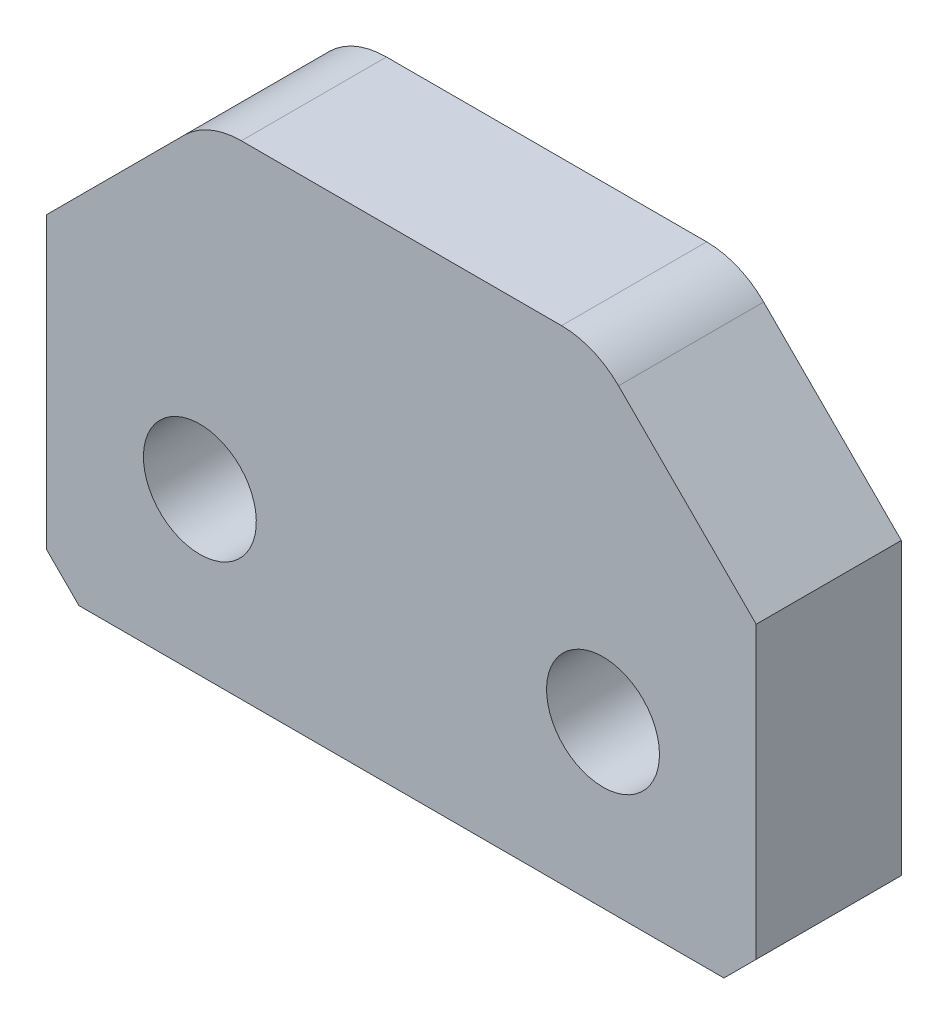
ISO-10303-21;
HEADER;
FILE_DESCRIPTION(('STEP AP214'),'2;1');
FILE_NAME('part.step','',(''),(''),'','','');
FILE_SCHEMA(('AUTOMOTIVE_DESIGN { 1 0 10303 214 1 1 1 1 }'));
ENDSEC;
DATA;
#1=APPLICATION_CONTEXT('core data for automotive mechanical design processes');
#2=APPLICATION_PROTOCOL_DEFINITION('international standard','automotive_design',2000,#1);
#3=PRODUCT_CONTEXT('',#1,'mechanical');
#4=PRODUCT('Part','Part','',(#3));
#5=PRODUCT_RELATED_PRODUCT_CATEGORY('part','',(#4));
#6=PRODUCT_DEFINITION_FORMATION('','',#4);
#7=PRODUCT_DEFINITION_CONTEXT('part definition',#1,'design');
#8=PRODUCT_DEFINITION('design','',#6,#7);
#9=PRODUCT_DEFINITION_SHAPE('','',#8);
#10=(LENGTH_UNIT() NAMED_UNIT(*) SI_UNIT(.MILLI.,.METRE.));
#11=(NAMED_UNIT(*) PLANE_ANGLE_UNIT() SI_UNIT($,.RADIAN.));
#12=(NAMED_UNIT(*) SI_UNIT($,.STERADIAN.) SOLID_ANGLE_UNIT());
#13=UNCERTAINTY_MEASURE_WITH_UNIT(LENGTH_MEASURE(1.E-05),#10,'distance_accuracy_value','');
#14=(GEOMETRIC_REPRESENTATION_CONTEXT(3) GLOBAL_UNCERTAINTY_ASSIGNED_CONTEXT((#13)) GLOBAL_UNIT_ASSIGNED_CONTEXT((#10,
#11,#12)) REPRESENTATION_CONTEXT('',''));
#15=CARTESIAN_POINT('',(0.,0.,0.));
#16=DIRECTION('',(0.,0.,1.));
#17=DIRECTION('',(1.,0.,0.));
#18=AXIS2_PLACEMENT_3D('',#15,#16,#17);
#19=CARTESIAN_POINT('',(2.57106781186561,15.,9.));
#20=DIRECTION('',(0.,0.,1.));
#21=DIRECTION('',(0.,-1.,0.));
#22=AXIS2_PLACEMENT_3D('',#19,#20,#21);
#23=PLANE('',#22);
#24=CARTESIAN_POINT('',(0.,0.,9.));
#25=DIRECTION('',(0.,0.,1.));
#26=DIRECTION('',(0.,-1.,0.));
#27=AXIS2_PLACEMENT_3D('',#24,#25,#26);
#28=CIRCLE('',#27,3.5);
#29=CARTESIAN_POINT('',(0.,-3.5,9.));
#30=VERTEX_POINT('',#29);
#31=EDGE_CURVE('E105',#30,#30,#28,.T.);
#32=ORIENTED_EDGE('',*,*,#31,.F.);
#33=EDGE_LOOP('',(#32));
#34=FACE_BOUND('',#33,.T.);
#35=CARTESIAN_POINT('',(2.57106781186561,15.,9.));
#36=DIRECTION('',(0.,0.,1.));
#37=DIRECTION('',(0.,-1.,0.));
#38=AXIS2_PLACEMENT_3D('',#35,#36,#37);
#39=CIRCLE('',#38,5.);
#40=CARTESIAN_POINT('',(2.57106781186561,20.,9.));
#41=VERTEX_POINT('',#40);
#42=CARTESIAN_POINT('',(-0.964466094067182,18.535533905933,9.));
#43=VERTEX_POINT('',#42);
#44=EDGE_CURVE('E134',#41,#43,#39,.T.);
#45=ORIENTED_EDGE('',*,*,#44,.T.);
#46=DIRECTION('',(0.707106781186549,0.707106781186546,0.));
#47=VECTOR('',#46,1.);
#48=CARTESIAN_POINT('',(-9.5,10.,9.));
#49=LINE('',#48,#47);
#50=CARTESIAN_POINT('',(-9.5,10.,9.));
#51=VERTEX_POINT('',#50);
#52=EDGE_CURVE('E97',#51,#43,#49,.T.);
#53=ORIENTED_EDGE('',*,*,#52,.F.);
#54=DIRECTION('',(0.,1.,0.));
#55=VECTOR('',#54,1.);
#56=CARTESIAN_POINT('',(-9.5,-8.,9.));
#57=LINE('',#56,#55);
#58=CARTESIAN_POINT('',(-9.5,-8.,9.));
#59=VERTEX_POINT('',#58);
#60=EDGE_CURVE('E137',#59,#51,#57,.T.);
#61=ORIENTED_EDGE('',*,*,#60,.F.);
#62=DIRECTION('',(-0.707106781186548,0.707106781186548,0.));
#63=VECTOR('',#62,1.);
#64=CARTESIAN_POINT('',(-7.5,-10.,9.));
#65=LINE('',#64,#63);
#66=CARTESIAN_POINT('',(-7.5,-10.,9.));
#67=VERTEX_POINT('',#66);
#68=EDGE_CURVE('E140',#67,#59,#65,.T.);
#69=ORIENTED_EDGE('',*,*,#68,.F.);
#70=DIRECTION('',(1.,0.,0.));
#71=VECTOR('',#70,1.);
#72=CARTESIAN_POINT('',(-7.5,-10.,9.));
#73=LINE('',#72,#71);
#74=CARTESIAN_POINT('',(32.5000000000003,-10.,9.));
#75=VERTEX_POINT('',#74);
#76=EDGE_CURVE('E143',#67,#75,#73,.T.);
#77=ORIENTED_EDGE('',*,*,#76,.T.);
#78=DIRECTION('',(-0.707106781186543,-0.707106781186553,0.));
#79=VECTOR('',#78,1.);
#80=CARTESIAN_POINT('',(34.5000000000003,-8.,9.));
#81=LINE('',#80,#79);
#82=CARTESIAN_POINT('',(34.5000000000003,-8.,9.));
#83=VERTEX_POINT('',#82);
#84=EDGE_CURVE('E146',#83,#75,#81,.T.);
#85=ORIENTED_EDGE('',*,*,#84,.F.);
#86=DIRECTION('',(0.,1.,0.));
#87=VECTOR('',#86,1.);
#88=CARTESIAN_POINT('',(34.5000000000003,-8.,9.));
#89=LINE('',#88,#87);
#90=CARTESIAN_POINT('',(34.5000000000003,10.,9.));
#91=VERTEX_POINT('',#90);
#92=EDGE_CURVE('E149',#83,#91,#89,.T.);
#93=ORIENTED_EDGE('',*,*,#92,.T.);
#94=DIRECTION('',(-0.707106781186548,0.707106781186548,0.));
#95=VECTOR('',#94,1.);
#96=CARTESIAN_POINT('',(34.5000000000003,10.,9.));
#97=LINE('',#96,#95);
#98=CARTESIAN_POINT('',(25.9644660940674,18.535533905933,9.));
#99=VERTEX_POINT('',#98);
#100=EDGE_CURVE('E152',#91,#99,#97,.T.);
#101=ORIENTED_EDGE('',*,*,#100,.T.);
#102=CARTESIAN_POINT('',(22.4289321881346,15.,9.));
#103=DIRECTION('',(0.,0.,1.));
#104=DIRECTION('',(0.,-1.,0.));
#105=AXIS2_PLACEMENT_3D('',#102,#103,#104);
#106=CIRCLE('',#105,5.);
#107=CARTESIAN_POINT('',(22.4289321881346,20.,9.));
#108=VERTEX_POINT('',#107);
#109=EDGE_CURVE('E155',#99,#108,#106,.T.);
#110=ORIENTED_EDGE('',*,*,#109,.T.);
#111=DIRECTION('',(1.,0.,0.));
#112=VECTOR('',#111,1.);
#113=CARTESIAN_POINT('',(2.57106781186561,20.,9.));
#114=LINE('',#113,#112);
#115=EDGE_CURVE('E157',#41,#108,#114,.T.);
#116=ORIENTED_EDGE('',*,*,#115,.F.);
#117=EDGE_LOOP('',(#45,#53,#61,#69,#77,#85,#93,#101,#110,#116));
#118=FACE_BOUND('',#117,.T.);
#119=CARTESIAN_POINT('',(25.,0.,9.));
#120=DIRECTION('',(0.,0.,1.));
#121=DIRECTION('',(0.,-1.,0.));
#122=AXIS2_PLACEMENT_3D('',#119,#120,#121);
#123=CIRCLE('',#122,3.5);
#124=CARTESIAN_POINT('',(25.,-3.5,9.));
#125=VERTEX_POINT('',#124);
#126=EDGE_CURVE('E329',#125,#125,#123,.T.);
#127=ORIENTED_EDGE('',*,*,#126,.F.);
#128=EDGE_LOOP('',(#127));
#129=FACE_BOUND('',#128,.T.);
#130=ADVANCED_FACE('F14',(#34,#118,#129),#23,.T.);
#131=CARTESIAN_POINT('',(2.57106781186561,15.,0.));
#132=DIRECTION('',(0.,0.,1.));
#133=DIRECTION('',(0.,-1.,0.));
#134=AXIS2_PLACEMENT_3D('',#131,#132,#133);
#135=PLANE('',#134);
#136=CARTESIAN_POINT('',(0.,0.,0.));
#137=DIRECTION('',(0.,0.,1.));
#138=DIRECTION('',(0.,-1.,0.));
#139=AXIS2_PLACEMENT_3D('',#136,#137,#138);
#140=CIRCLE('',#139,3.5);
#141=CARTESIAN_POINT('',(0.,-3.5,0.));
#142=VERTEX_POINT('',#141);
#143=EDGE_CURVE('E334',#142,#142,#140,.T.);
#144=ORIENTED_EDGE('',*,*,#143,.T.);
#145=EDGE_LOOP('',(#144));
#146=FACE_BOUND('',#145,.T.);
#147=CARTESIAN_POINT('',(2.57106781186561,15.,0.));
#148=DIRECTION('',(0.,0.,1.));
#149=DIRECTION('',(0.,-1.,0.));
#150=AXIS2_PLACEMENT_3D('',#147,#148,#149);
#151=CIRCLE('',#150,5.);
#152=CARTESIAN_POINT('',(2.57106781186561,20.,0.));
#153=VERTEX_POINT('',#152);
#154=CARTESIAN_POINT('',(-0.964466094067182,18.535533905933,0.));
#155=VERTEX_POINT('',#154);
#156=EDGE_CURVE('E101',#153,#155,#151,.T.);
#157=ORIENTED_EDGE('',*,*,#156,.F.);
#158=DIRECTION('',(1.,0.,0.));
#159=VECTOR('',#158,1.);
#160=CARTESIAN_POINT('',(2.57106781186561,20.,0.));
#161=LINE('',#160,#159);
#162=CARTESIAN_POINT('',(22.4289321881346,20.,0.));
#163=VERTEX_POINT('',#162);
#164=EDGE_CURVE('E132',#153,#163,#161,.T.);
#165=ORIENTED_EDGE('',*,*,#164,.T.);
#166=CARTESIAN_POINT('',(22.4289321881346,15.,0.));
#167=DIRECTION('',(0.,0.,1.));
#168=DIRECTION('',(0.,-1.,0.));
#169=AXIS2_PLACEMENT_3D('',#166,#167,#168);
#170=CIRCLE('',#169,5.);
#171=CARTESIAN_POINT('',(25.9644660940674,18.535533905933,0.));
#172=VERTEX_POINT('',#171);
#173=EDGE_CURVE('E130',#172,#163,#170,.T.);
#174=ORIENTED_EDGE('',*,*,#173,.F.);
#175=DIRECTION('',(-0.707106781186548,0.707106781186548,0.));
#176=VECTOR('',#175,1.);
#177=CARTESIAN_POINT('',(34.5000000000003,10.,0.));
#178=LINE('',#177,#176);
#179=CARTESIAN_POINT('',(34.5000000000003,10.,0.));
#180=VERTEX_POINT('',#179);
#181=EDGE_CURVE('E127',#180,#172,#178,.T.);
#182=ORIENTED_EDGE('',*,*,#181,.F.);
#183=DIRECTION('',(0.,1.,0.));
#184=VECTOR('',#183,1.);
#185=CARTESIAN_POINT('',(34.5000000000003,-8.,0.));
#186=LINE('',#185,#184);
#187=CARTESIAN_POINT('',(34.5000000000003,-8.,0.));
#188=VERTEX_POINT('',#187);
#189=EDGE_CURVE('E124',#188,#180,#186,.T.);
#190=ORIENTED_EDGE('',*,*,#189,.F.);
#191=DIRECTION('',(-0.707106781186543,-0.707106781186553,0.));
#192=VECTOR('',#191,1.);
#193=CARTESIAN_POINT('',(34.5000000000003,-8.,0.));
#194=LINE('',#193,#192);
#195=CARTESIAN_POINT('',(32.5000000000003,-10.,0.));
#196=VERTEX_POINT('',#195);
#197=EDGE_CURVE('E121',#188,#196,#194,.T.);
#198=ORIENTED_EDGE('',*,*,#197,.T.);
#199=DIRECTION('',(1.,0.,0.));
#200=VECTOR('',#199,1.);
#201=CARTESIAN_POINT('',(-7.5,-10.,0.));
#202=LINE('',#201,#200);
#203=CARTESIAN_POINT('',(-7.5,-10.,0.));
#204=VERTEX_POINT('',#203);
#205=EDGE_CURVE('E118',#204,#196,#202,.T.);
#206=ORIENTED_EDGE('',*,*,#205,.F.);
#207=DIRECTION('',(-0.707106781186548,0.707106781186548,0.));
#208=VECTOR('',#207,1.);
#209=CARTESIAN_POINT('',(-7.5,-10.,0.));
#210=LINE('',#209,#208);
#211=CARTESIAN_POINT('',(-9.5,-8.,0.));
#212=VERTEX_POINT('',#211);
#213=EDGE_CURVE('E113',#204,#212,#210,.T.);
#214=ORIENTED_EDGE('',*,*,#213,.T.);
#215=DIRECTION('',(0.,1.,0.));
#216=VECTOR('',#215,1.);
#217=CARTESIAN_POINT('',(-9.5,-8.,0.));
#218=LINE('',#217,#216);
#219=CARTESIAN_POINT('',(-9.5,10.,0.));
#220=VERTEX_POINT('',#219);
#221=EDGE_CURVE('E111',#212,#220,#218,.T.);
#222=ORIENTED_EDGE('',*,*,#221,.T.);
#223=DIRECTION('',(0.707106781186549,0.707106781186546,0.));
#224=VECTOR('',#223,1.);
#225=CARTESIAN_POINT('',(-9.5,10.,0.));
#226=LINE('',#225,#224);
#227=EDGE_CURVE('E94',#220,#155,#226,.T.);
#228=ORIENTED_EDGE('',*,*,#227,.T.);
#229=EDGE_LOOP('',(#157,#165,#174,#182,#190,#198,#206,#214,#222,#228));
#230=FACE_BOUND('',#229,.T.);
#231=CARTESIAN_POINT('',(25.,0.,0.));
#232=DIRECTION('',(0.,0.,1.));
#233=DIRECTION('',(0.,-1.,0.));
#234=AXIS2_PLACEMENT_3D('',#231,#232,#233);
#235=CIRCLE('',#234,3.5);
#236=CARTESIAN_POINT('',(25.,-3.5,0.));
#237=VERTEX_POINT('',#236);
#238=EDGE_CURVE('E332',#237,#237,#235,.T.);
#239=ORIENTED_EDGE('',*,*,#238,.T.);
#240=EDGE_LOOP('',(#239));
#241=FACE_BOUND('',#240,.T.);
#242=ADVANCED_FACE('F107',(#146,#230,#241),#135,.F.);
#243=CARTESIAN_POINT('',(2.57106781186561,15.,9.));
#244=DIRECTION('',(0.,0.,-1.));
#245=DIRECTION('',(0.,1.,0.));
#246=AXIS2_PLACEMENT_3D('',#243,#244,#245);
#247=CYLINDRICAL_SURFACE('',#246,5.);
#248=DIRECTION('',(0.,0.,-1.));
#249=VECTOR('',#248,1.);
#250=CARTESIAN_POINT('',(-0.964466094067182,18.535533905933,9.));
#251=LINE('',#250,#249);
#252=EDGE_CURVE('E9',#43,#155,#251,.T.);
#253=ORIENTED_EDGE('',*,*,#252,.F.);
#254=ORIENTED_EDGE('',*,*,#44,.F.);
#255=DIRECTION('',(0.,0.,-1.));
#256=VECTOR('',#255,1.);
#257=CARTESIAN_POINT('',(2.57106781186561,20.,9.));
#258=LINE('',#257,#256);
#259=EDGE_CURVE('E29',#41,#153,#258,.T.);
#260=ORIENTED_EDGE('',*,*,#259,.T.);
#261=ORIENTED_EDGE('',*,*,#156,.T.);
#262=EDGE_LOOP('',(#253,#254,#260,#261));
#263=FACE_BOUND('',#262,.T.);
#264=ADVANCED_FACE('F102',(#263),#247,.T.);
#265=CARTESIAN_POINT('',(-9.5,10.,9.));
#266=DIRECTION('',(-0.707106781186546,0.707106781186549,0.));
#267=DIRECTION('',(-0.707106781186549,-0.707106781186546,0.));
#268=AXIS2_PLACEMENT_3D('',#265,#266,#267);
#269=PLANE('',#268);
#270=DIRECTION('',(0.,0.,-1.));
#271=VECTOR('',#270,1.);
#272=CARTESIAN_POINT('',(-9.5,10.,9.));
#273=LINE('',#272,#271);
#274=EDGE_CURVE('E22',#51,#220,#273,.T.);
#275=ORIENTED_EDGE('',*,*,#274,.F.);
#276=ORIENTED_EDGE('',*,*,#52,.T.);
#277=ORIENTED_EDGE('',*,*,#252,.T.);
#278=ORIENTED_EDGE('',*,*,#227,.F.);
#279=EDGE_LOOP('',(#275,#276,#277,#278));
#280=FACE_BOUND('',#279,.T.);
#281=ADVANCED_FACE('F16',(#280),#269,.T.);
#282=CARTESIAN_POINT('',(-9.5,-8.,9.));
#283=DIRECTION('',(-1.,0.,0.));
#284=DIRECTION('',(0.,0.,-1.));
#285=AXIS2_PLACEMENT_3D('',#282,#283,#284);
#286=PLANE('',#285);
#287=DIRECTION('',(0.,0.,-1.));
#288=VECTOR('',#287,1.);
#289=CARTESIAN_POINT('',(-9.5,-8.,9.));
#290=LINE('',#289,#288);
#291=EDGE_CURVE('E171',#59,#212,#290,.T.);
#292=ORIENTED_EDGE('',*,*,#291,.F.);
#293=ORIENTED_EDGE('',*,*,#60,.T.);
#294=ORIENTED_EDGE('',*,*,#274,.T.);
#295=ORIENTED_EDGE('',*,*,#221,.F.);
#296=EDGE_LOOP('',(#292,#293,#294,#295));
#297=FACE_BOUND('',#296,.T.);
#298=ADVANCED_FACE('F173',(#297),#286,.T.);
#299=CARTESIAN_POINT('',(-7.5,-10.,9.));
#300=DIRECTION('',(-0.707106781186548,-0.707106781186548,0.));
#301=DIRECTION('',(0.707106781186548,-0.707106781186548,0.));
#302=AXIS2_PLACEMENT_3D('',#299,#300,#301);
#303=PLANE('',#302);
#304=DIRECTION('',(0.,0.,-1.));
#305=VECTOR('',#304,1.);
#306=CARTESIAN_POINT('',(-7.5,-10.,9.));
#307=LINE('',#306,#305);
#308=EDGE_CURVE('E169',#67,#204,#307,.T.);
#309=ORIENTED_EDGE('',*,*,#308,.F.);
#310=ORIENTED_EDGE('',*,*,#68,.T.);
#311=ORIENTED_EDGE('',*,*,#291,.T.);
#312=ORIENTED_EDGE('',*,*,#213,.F.);
#313=EDGE_LOOP('',(#309,#310,#311,#312));
#314=FACE_BOUND('',#313,.T.);
#315=ADVANCED_FACE('F200',(#314),#303,.T.);
#316=CARTESIAN_POINT('',(-7.5,-10.,9.));
#317=DIRECTION('',(0.,1.,0.));
#318=DIRECTION('',(0.,0.,1.));
#319=AXIS2_PLACEMENT_3D('',#316,#317,#318);
#320=PLANE('',#319);
#321=DIRECTION('',(0.,0.,-1.));
#322=VECTOR('',#321,1.);
#323=CARTESIAN_POINT('',(32.5000000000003,-10.,9.));
#324=LINE('',#323,#322);
#325=EDGE_CURVE('E167',#75,#196,#324,.T.);
#326=ORIENTED_EDGE('',*,*,#325,.F.);
#327=ORIENTED_EDGE('',*,*,#76,.F.);
#328=ORIENTED_EDGE('',*,*,#308,.T.);
#329=ORIENTED_EDGE('',*,*,#205,.T.);
#330=EDGE_LOOP('',(#326,#327,#328,#329));
#331=FACE_BOUND('',#330,.T.);
#332=ADVANCED_FACE('F197',(#331),#320,.F.);
#333=CARTESIAN_POINT('',(34.5000000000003,-8.,9.));
#334=DIRECTION('',(0.707106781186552,-0.707106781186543,0.));
#335=DIRECTION('',(0.707106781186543,0.707106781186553,0.));
#336=AXIS2_PLACEMENT_3D('',#333,#334,#335);
#337=PLANE('',#336);
#338=DIRECTION('',(0.,0.,-1.));
#339=VECTOR('',#338,1.);
#340=CARTESIAN_POINT('',(34.5000000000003,-8.,9.));
#341=LINE('',#340,#339);
#342=EDGE_CURVE('E165',#83,#188,#341,.T.);
#343=ORIENTED_EDGE('',*,*,#342,.F.);
#344=ORIENTED_EDGE('',*,*,#84,.T.);
#345=ORIENTED_EDGE('',*,*,#325,.T.);
#346=ORIENTED_EDGE('',*,*,#197,.F.);
#347=EDGE_LOOP('',(#343,#344,#345,#346));
#348=FACE_BOUND('',#347,.T.);
#349=ADVANCED_FACE('F193',(#348),#337,.T.);
#350=CARTESIAN_POINT('',(34.5000000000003,-8.,9.));
#351=DIRECTION('',(-1.,0.,0.));
#352=DIRECTION('',(0.,0.,-1.));
#353=AXIS2_PLACEMENT_3D('',#350,#351,#352);
#354=PLANE('',#353);
#355=DIRECTION('',(0.,0.,-1.));
#356=VECTOR('',#355,1.);
#357=CARTESIAN_POINT('',(34.5000000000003,10.,9.));
#358=LINE('',#357,#356);
#359=EDGE_CURVE('E163',#91,#180,#358,.T.);
#360=ORIENTED_EDGE('',*,*,#359,.F.);
#361=ORIENTED_EDGE('',*,*,#92,.F.);
#362=ORIENTED_EDGE('',*,*,#342,.T.);
#363=ORIENTED_EDGE('',*,*,#189,.T.);
#364=EDGE_LOOP('',(#360,#361,#362,#363));
#365=FACE_BOUND('',#364,.T.);
#366=ADVANCED_FACE('F189',(#365),#354,.F.);
#367=CARTESIAN_POINT('',(34.5000000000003,10.,9.));
#368=DIRECTION('',(-0.707106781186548,-0.707106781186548,0.));
#369=DIRECTION('',(0.707106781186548,-0.707106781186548,0.));
#370=AXIS2_PLACEMENT_3D('',#367,#368,#369);
#371=PLANE('',#370);
#372=DIRECTION('',(0.,0.,-1.));
#373=VECTOR('',#372,1.);
#374=CARTESIAN_POINT('',(25.9644660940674,18.535533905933,9.));
#375=LINE('',#374,#373);
#376=EDGE_CURVE('E161',#99,#172,#375,.T.);
#377=ORIENTED_EDGE('',*,*,#376,.F.);
#378=ORIENTED_EDGE('',*,*,#100,.F.);
#379=ORIENTED_EDGE('',*,*,#359,.T.);
#380=ORIENTED_EDGE('',*,*,#181,.T.);
#381=EDGE_LOOP('',(#377,#378,#379,#380));
#382=FACE_BOUND('',#381,.T.);
#383=ADVANCED_FACE('F185',(#382),#371,.F.);
#384=CARTESIAN_POINT('',(22.4289321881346,15.,9.));
#385=DIRECTION('',(0.,0.,-1.));
#386=DIRECTION('',(0.,1.,0.));
#387=AXIS2_PLACEMENT_3D('',#384,#385,#386);
#388=CYLINDRICAL_SURFACE('',#387,5.);
#389=DIRECTION('',(0.,0.,-1.));
#390=VECTOR('',#389,1.);
#391=CARTESIAN_POINT('',(22.4289321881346,20.,9.));
#392=LINE('',#391,#390);
#393=EDGE_CURVE('E37',#108,#163,#392,.T.);
#394=ORIENTED_EDGE('',*,*,#393,.F.);
#395=ORIENTED_EDGE('',*,*,#109,.F.);
#396=ORIENTED_EDGE('',*,*,#376,.T.);
#397=ORIENTED_EDGE('',*,*,#173,.T.);
#398=EDGE_LOOP('',(#394,#395,#396,#397));
#399=FACE_BOUND('',#398,.T.);
#400=ADVANCED_FACE('F181',(#399),#388,.T.);
#401=CARTESIAN_POINT('',(2.57106781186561,20.,9.));
#402=DIRECTION('',(0.,1.,0.));
#403=DIRECTION('',(-1.,0.,0.));
#404=AXIS2_PLACEMENT_3D('',#401,#402,#403);
#405=PLANE('',#404);
#406=ORIENTED_EDGE('',*,*,#115,.T.);
#407=ORIENTED_EDGE('',*,*,#393,.T.);
#408=ORIENTED_EDGE('',*,*,#164,.F.);
#409=ORIENTED_EDGE('',*,*,#259,.F.);
#410=EDGE_LOOP('',(#406,#407,#408,#409));
#411=FACE_BOUND('',#410,.T.);
#412=ADVANCED_FACE('F179',(#411),#405,.T.);
#413=CARTESIAN_POINT('',(0.,0.,9.));
#414=DIRECTION('',(0.,0.,-1.));
#415=DIRECTION('',(0.,1.,0.));
#416=AXIS2_PLACEMENT_3D('',#413,#414,#415);
#417=CYLINDRICAL_SURFACE('',#416,3.5);
#418=ORIENTED_EDGE('',*,*,#31,.T.);
#419=EDGE_LOOP('',(#418));
#420=FACE_BOUND('',#419,.T.);
#421=ORIENTED_EDGE('',*,*,#143,.F.);
#422=EDGE_LOOP('',(#421));
#423=FACE_BOUND('',#422,.T.);
#424=ADVANCED_FACE('F226',(#420,#423),#417,.F.);
#425=CARTESIAN_POINT('',(25.,0.,9.));
#426=DIRECTION('',(0.,0.,-1.));
#427=DIRECTION('',(0.,1.,0.));
#428=AXIS2_PLACEMENT_3D('',#425,#426,#427);
#429=CYLINDRICAL_SURFACE('',#428,3.5);
#430=ORIENTED_EDGE('',*,*,#126,.T.);
#431=EDGE_LOOP('',(#430));
#432=FACE_BOUND('',#431,.T.);
#433=ORIENTED_EDGE('',*,*,#238,.F.);
#434=EDGE_LOOP('',(#433));
#435=FACE_BOUND('',#434,.T.);
#436=ADVANCED_FACE('F271',(#432,#435),#429,.F.);
#437=CLOSED_SHELL('',(#130,#242,#264,#281,#298,#315,#332,#349,#366,#383,#400,#412,#424,#436));
#438=MANIFOLD_SOLID_BREP('B1',#437);
#439=ADVANCED_BREP_SHAPE_REPRESENTATION('',(#18,#438),#14);
#440=SHAPE_DEFINITION_REPRESENTATION(#9,#439);
ENDSEC;
END-ISO-10303-21;
